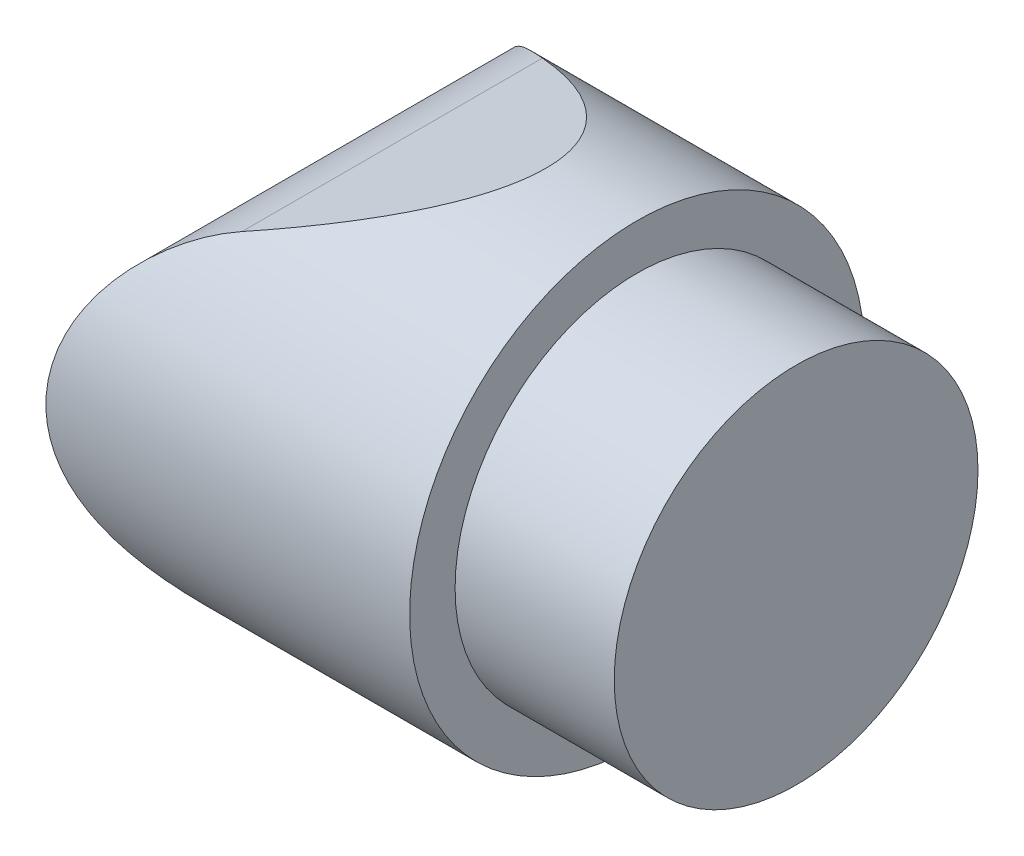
from build123d import *

# Parameters (mm, degrees)
SKETCH_1_R          = 50
EXTRUDE_1_DEPTH     = 100
SKETCH_1_3_R        = 40
EXTRUDE_2_DEPTH     = 35
CUT_EXTRUDE_1_DEPTH = 50


with BuildPart() as part:
    # Sketch 1 → Extrude 1 (new body)
    with BuildSketch(Plane(origin=(0, 0, 0), x_dir=(0, 0, -1), z_dir=(1, 0, 0))):
        Circle(SKETCH_1_R)
    extrude(amount=-EXTRUDE_1_DEPTH)

    # Sketch 1_3 → Extrude 2 (add)
    with BuildSketch(Plane(origin=(0, 0, 0), x_dir=(0, 0, -1), z_dir=(1, 0, 0))):
        Circle(SKETCH_1_3_R)
    extrude(amount=EXTRUDE_2_DEPTH)

    # Sketch 2 → Cut-Extrude 1 (cut, symmetric)
    with BuildSketch(Plane.XY):
        with BuildLine():
            Line((-20, 50), (-53.831388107, 37.532555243))
            ThreePointArc((-53.831388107, 37.532555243), (-80, 0), (-53.831388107, -37.532555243))
            Line((-53.831388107, -37.532555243), (-20, -50))
            Line((-20, -50), (-100, -50))
            Line((-100, -50), (-100, 50))
            Line((-100, 50), (-20, 50))
        make_face()
    extrude(amount=CUT_EXTRUDE_1_DEPTH, both=True, mode=Mode.SUBTRACT)


solid = part.part
